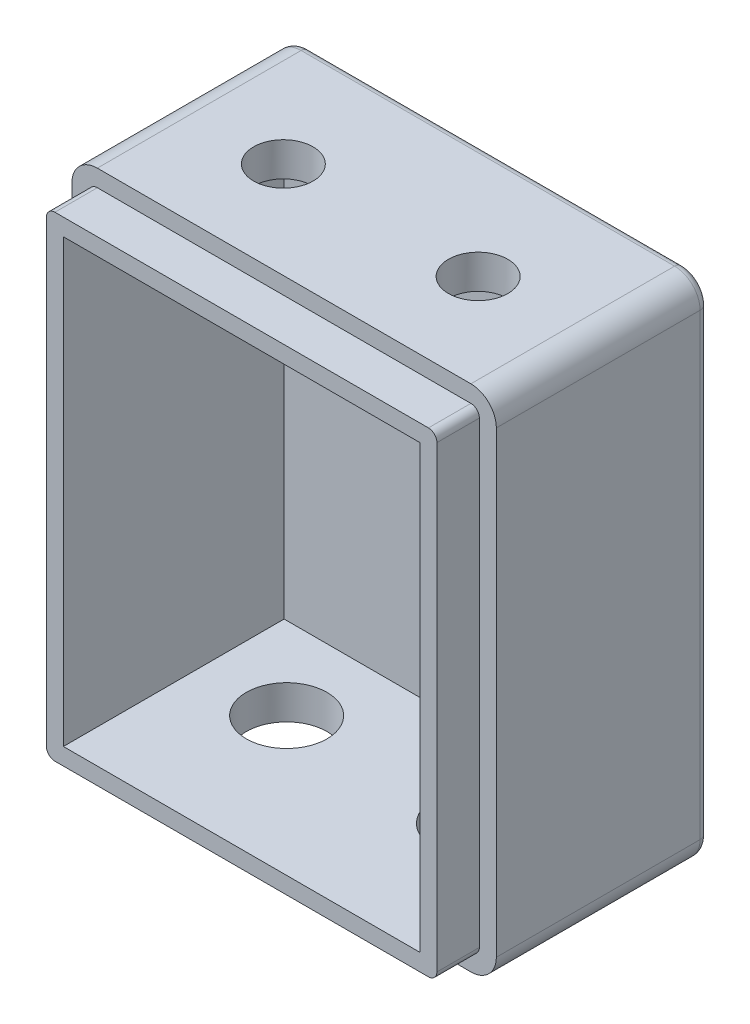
ISO-10303-21;
HEADER;
FILE_DESCRIPTION(('STEP AP214'),'2;1');
FILE_NAME('part.step','',(''),(''),'','','');
FILE_SCHEMA(('AUTOMOTIVE_DESIGN { 1 0 10303 214 1 1 1 1 }'));
ENDSEC;
DATA;
#1=APPLICATION_CONTEXT('core data for automotive mechanical design processes');
#2=APPLICATION_PROTOCOL_DEFINITION('international standard','automotive_design',2000,#1);
#3=PRODUCT_CONTEXT('',#1,'mechanical');
#4=PRODUCT('Part','Part','',(#3));
#5=PRODUCT_RELATED_PRODUCT_CATEGORY('part','',(#4));
#6=PRODUCT_DEFINITION_FORMATION('','',#4);
#7=PRODUCT_DEFINITION_CONTEXT('part definition',#1,'design');
#8=PRODUCT_DEFINITION('design','',#6,#7);
#9=PRODUCT_DEFINITION_SHAPE('','',#8);
#10=(LENGTH_UNIT() NAMED_UNIT(*) SI_UNIT(.MILLI.,.METRE.));
#11=(NAMED_UNIT(*) PLANE_ANGLE_UNIT() SI_UNIT($,.RADIAN.));
#12=(NAMED_UNIT(*) SI_UNIT($,.STERADIAN.) SOLID_ANGLE_UNIT());
#13=UNCERTAINTY_MEASURE_WITH_UNIT(LENGTH_MEASURE(1.E-05),#10,'distance_accuracy_value','');
#14=(GEOMETRIC_REPRESENTATION_CONTEXT(3) GLOBAL_UNCERTAINTY_ASSIGNED_CONTEXT((#13)) GLOBAL_UNIT_ASSIGNED_CONTEXT((#10,
#11,#12)) REPRESENTATION_CONTEXT('',''));
#15=CARTESIAN_POINT('',(0.,0.,0.));
#16=DIRECTION('',(0.,0.,1.));
#17=DIRECTION('',(1.,0.,0.));
#18=AXIS2_PLACEMENT_3D('',#15,#16,#17);
#19=CARTESIAN_POINT('',(0.,0.,30.));
#20=DIRECTION('',(0.,0.,-1.));
#21=DIRECTION('',(-1.,0.,0.));
#22=AXIS2_PLACEMENT_3D('',#19,#20,#21);
#23=PLANE('',#22);
#24=DIRECTION('',(1.,0.,0.));
#25=VECTOR('',#24,1.);
#26=CARTESIAN_POINT('',(0.,4.,30.));
#27=LINE('',#26,#25);
#28=CARTESIAN_POINT('',(4.,4.,30.));
#29=VERTEX_POINT('',#28);
#30=CARTESIAN_POINT('',(46.,4.,30.));
#31=VERTEX_POINT('',#30);
#32=EDGE_CURVE('E311',#29,#31,#27,.T.);
#33=ORIENTED_EDGE('',*,*,#32,.F.);
#34=DIRECTION('',(0.,-1.,0.));
#35=VECTOR('',#34,1.);
#36=CARTESIAN_POINT('',(4.,0.,30.));
#37=LINE('',#36,#35);
#38=CARTESIAN_POINT('',(4.,56.,30.));
#39=VERTEX_POINT('',#38);
#40=EDGE_CURVE('E308',#39,#29,#37,.T.);
#41=ORIENTED_EDGE('',*,*,#40,.F.);
#42=DIRECTION('',(-1.,0.,0.));
#43=VECTOR('',#42,1.);
#44=CARTESIAN_POINT('',(0.,56.,30.));
#45=LINE('',#44,#43);
#46=CARTESIAN_POINT('',(46.,56.,30.));
#47=VERTEX_POINT('',#46);
#48=EDGE_CURVE('E306',#47,#39,#45,.T.);
#49=ORIENTED_EDGE('',*,*,#48,.F.);
#50=DIRECTION('',(0.,1.,0.));
#51=VECTOR('',#50,1.);
#52=CARTESIAN_POINT('',(46.,0.,30.));
#53=LINE('',#52,#51);
#54=EDGE_CURVE('E314',#31,#47,#53,.T.);
#55=ORIENTED_EDGE('',*,*,#54,.F.);
#56=EDGE_LOOP('',(#33,#41,#49,#55));
#57=FACE_BOUND('',#56,.T.);
#58=CARTESIAN_POINT('',(3.,3.,30.));
#59=DIRECTION('',(0.,0.,1.));
#60=DIRECTION('',(1.,0.,0.));
#61=AXIS2_PLACEMENT_3D('',#58,#59,#60);
#62=CIRCLE('',#61,1.);
#63=CARTESIAN_POINT('',(2.,3.,30.));
#64=VERTEX_POINT('',#63);
#65=CARTESIAN_POINT('',(3.,2.,30.));
#66=VERTEX_POINT('',#65);
#67=EDGE_CURVE('E246',#64,#66,#62,.T.);
#68=ORIENTED_EDGE('',*,*,#67,.T.);
#69=DIRECTION('',(1.,0.,0.));
#70=VECTOR('',#69,1.);
#71=CARTESIAN_POINT('',(3.,2.,30.));
#72=LINE('',#71,#70);
#73=CARTESIAN_POINT('',(47.,2.,30.));
#74=VERTEX_POINT('',#73);
#75=EDGE_CURVE('E203',#66,#74,#72,.T.);
#76=ORIENTED_EDGE('',*,*,#75,.T.);
#77=CARTESIAN_POINT('',(47.,3.,30.));
#78=DIRECTION('',(0.,0.,1.));
#79=DIRECTION('',(1.,0.,0.));
#80=AXIS2_PLACEMENT_3D('',#77,#78,#79);
#81=CIRCLE('',#80,1.);
#82=CARTESIAN_POINT('',(48.,3.,30.));
#83=VERTEX_POINT('',#82);
#84=EDGE_CURVE('E52',#74,#83,#81,.T.);
#85=ORIENTED_EDGE('',*,*,#84,.T.);
#86=DIRECTION('',(0.,1.,0.));
#87=VECTOR('',#86,1.);
#88=CARTESIAN_POINT('',(48.,3.,30.));
#89=LINE('',#88,#87);
#90=CARTESIAN_POINT('',(48.,57.,30.));
#91=VERTEX_POINT('',#90);
#92=EDGE_CURVE('E250',#83,#91,#89,.T.);
#93=ORIENTED_EDGE('',*,*,#92,.T.);
#94=CARTESIAN_POINT('',(47.,57.,30.));
#95=DIRECTION('',(0.,0.,1.));
#96=DIRECTION('',(1.,0.,0.));
#97=AXIS2_PLACEMENT_3D('',#94,#95,#96);
#98=CIRCLE('',#97,1.);
#99=CARTESIAN_POINT('',(47.,58.,30.));
#100=VERTEX_POINT('',#99);
#101=EDGE_CURVE('E253',#91,#100,#98,.T.);
#102=ORIENTED_EDGE('',*,*,#101,.T.);
#103=DIRECTION('',(-1.,0.,0.));
#104=VECTOR('',#103,1.);
#105=CARTESIAN_POINT('',(47.,58.,30.));
#106=LINE('',#105,#104);
#107=CARTESIAN_POINT('',(3.,58.,30.));
#108=VERTEX_POINT('',#107);
#109=EDGE_CURVE('E256',#100,#108,#106,.T.);
#110=ORIENTED_EDGE('',*,*,#109,.T.);
#111=CARTESIAN_POINT('',(3.,57.,30.));
#112=DIRECTION('',(0.,0.,1.));
#113=DIRECTION('',(1.,0.,0.));
#114=AXIS2_PLACEMENT_3D('',#111,#112,#113);
#115=CIRCLE('',#114,1.);
#116=CARTESIAN_POINT('',(2.,57.,30.));
#117=VERTEX_POINT('',#116);
#118=EDGE_CURVE('E226',#108,#117,#115,.T.);
#119=ORIENTED_EDGE('',*,*,#118,.T.);
#120=DIRECTION('',(0.,-1.,0.));
#121=VECTOR('',#120,1.);
#122=CARTESIAN_POINT('',(2.,57.,30.));
#123=LINE('',#122,#121);
#124=EDGE_CURVE('E223',#117,#64,#123,.T.);
#125=ORIENTED_EDGE('',*,*,#124,.T.);
#126=EDGE_LOOP('',(#68,#76,#85,#93,#102,#110,#119,#125));
#127=FACE_BOUND('',#126,.T.);
#128=ADVANCED_FACE('F35',(#57,#127),#23,.F.);
#129=CARTESIAN_POINT('',(4.,0.,30.));
#130=DIRECTION('',(1.,0.,0.));
#131=DIRECTION('',(0.,0.,-1.));
#132=AXIS2_PLACEMENT_3D('',#129,#130,#131);
#133=PLANE('',#132);
#134=DIRECTION('',(0.,-1.,0.));
#135=VECTOR('',#134,1.);
#136=CARTESIAN_POINT('',(4.,0.,4.));
#137=LINE('',#136,#135);
#138=CARTESIAN_POINT('',(4.,56.,4.));
#139=VERTEX_POINT('',#138);
#140=CARTESIAN_POINT('',(4.,4.,4.));
#141=VERTEX_POINT('',#140);
#142=EDGE_CURVE('E289',#139,#141,#137,.T.);
#143=ORIENTED_EDGE('',*,*,#142,.F.);
#144=DIRECTION('',(0.,0.,1.));
#145=VECTOR('',#144,1.);
#146=CARTESIAN_POINT('',(4.,56.,30.));
#147=LINE('',#146,#145);
#148=EDGE_CURVE('E294',#139,#39,#147,.T.);
#149=ORIENTED_EDGE('',*,*,#148,.T.);
#150=ORIENTED_EDGE('',*,*,#40,.T.);
#151=DIRECTION('',(0.,0.,1.));
#152=VECTOR('',#151,1.);
#153=CARTESIAN_POINT('',(4.,4.,30.));
#154=LINE('',#153,#152);
#155=EDGE_CURVE('E292',#141,#29,#154,.T.);
#156=ORIENTED_EDGE('',*,*,#155,.F.);
#157=EDGE_LOOP('',(#143,#149,#150,#156));
#158=FACE_BOUND('',#157,.T.);
#159=ADVANCED_FACE('F471',(#158),#133,.T.);
#160=CARTESIAN_POINT('',(0.,4.,30.));
#161=DIRECTION('',(0.,1.,0.));
#162=DIRECTION('',(0.,0.,1.));
#163=AXIS2_PLACEMENT_3D('',#160,#161,#162);
#164=PLANE('',#163);
#165=CARTESIAN_POINT('',(14.,4.,13.7001851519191));
#166=DIRECTION('',(0.,1.,0.));
#167=DIRECTION('',(0.,0.,1.));
#168=AXIS2_PLACEMENT_3D('',#165,#166,#167);
#169=CIRCLE('',#168,4.75);
#170=CARTESIAN_POINT('',(14.,4.,18.4501851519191));
#171=VERTEX_POINT('',#170);
#172=EDGE_CURVE('E789',#171,#171,#169,.F.);
#173=ORIENTED_EDGE('',*,*,#172,.T.);
#174=EDGE_LOOP('',(#173));
#175=FACE_BOUND('',#174,.T.);
#176=CARTESIAN_POINT('',(36.,4.,13.7001851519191));
#177=DIRECTION('',(0.,1.,0.));
#178=DIRECTION('',(0.,0.,1.));
#179=AXIS2_PLACEMENT_3D('',#176,#177,#178);
#180=CIRCLE('',#179,4.75);
#181=CARTESIAN_POINT('',(36.,4.,18.4501851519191));
#182=VERTEX_POINT('',#181);
#183=EDGE_CURVE('E793',#182,#182,#180,.F.);
#184=ORIENTED_EDGE('',*,*,#183,.T.);
#185=EDGE_LOOP('',(#184));
#186=FACE_BOUND('',#185,.T.);
#187=DIRECTION('',(1.,0.,0.));
#188=VECTOR('',#187,1.);
#189=CARTESIAN_POINT('',(0.,4.,4.));
#190=LINE('',#189,#188);
#191=CARTESIAN_POINT('',(46.,4.,4.));
#192=VERTEX_POINT('',#191);
#193=EDGE_CURVE('E291',#141,#192,#190,.T.);
#194=ORIENTED_EDGE('',*,*,#193,.F.);
#195=ORIENTED_EDGE('',*,*,#155,.T.);
#196=ORIENTED_EDGE('',*,*,#32,.T.);
#197=DIRECTION('',(0.,0.,1.));
#198=VECTOR('',#197,1.);
#199=CARTESIAN_POINT('',(46.,4.,30.));
#200=LINE('',#199,#198);
#201=EDGE_CURVE('E295',#192,#31,#200,.T.);
#202=ORIENTED_EDGE('',*,*,#201,.F.);
#203=EDGE_LOOP('',(#194,#195,#196,#202));
#204=FACE_BOUND('',#203,.T.);
#205=ADVANCED_FACE('F477',(#175,#186,#204),#164,.T.);
#206=CARTESIAN_POINT('',(46.,0.,30.));
#207=DIRECTION('',(-1.,0.,0.));
#208=DIRECTION('',(0.,0.,1.));
#209=AXIS2_PLACEMENT_3D('',#206,#207,#208);
#210=PLANE('',#209);
#211=ORIENTED_EDGE('',*,*,#54,.T.);
#212=DIRECTION('',(0.,0.,1.));
#213=VECTOR('',#212,1.);
#214=CARTESIAN_POINT('',(46.,56.,30.));
#215=LINE('',#214,#213);
#216=CARTESIAN_POINT('',(46.,56.,4.));
#217=VERTEX_POINT('',#216);
#218=EDGE_CURVE('E302',#217,#47,#215,.T.);
#219=ORIENTED_EDGE('',*,*,#218,.F.);
#220=DIRECTION('',(0.,1.,0.));
#221=VECTOR('',#220,1.);
#222=CARTESIAN_POINT('',(46.,0.,4.));
#223=LINE('',#222,#221);
#224=EDGE_CURVE('E300',#192,#217,#223,.T.);
#225=ORIENTED_EDGE('',*,*,#224,.F.);
#226=ORIENTED_EDGE('',*,*,#201,.T.);
#227=EDGE_LOOP('',(#211,#219,#225,#226));
#228=FACE_BOUND('',#227,.T.);
#229=ADVANCED_FACE('F737',(#228),#210,.T.);
#230=CARTESIAN_POINT('',(0.,56.,30.));
#231=DIRECTION('',(0.,-1.,0.));
#232=DIRECTION('',(0.,0.,-1.));
#233=AXIS2_PLACEMENT_3D('',#230,#231,#232);
#234=PLANE('',#233);
#235=CARTESIAN_POINT('',(36.4730775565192,56.,13.6186261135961));
#236=DIRECTION('',(0.,-1.,0.));
#237=DIRECTION('',(0.,0.,-1.));
#238=AXIS2_PLACEMENT_3D('',#235,#236,#237);
#239=CIRCLE('',#238,3.5);
#240=CARTESIAN_POINT('',(36.4730775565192,56.,10.1186261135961));
#241=VERTEX_POINT('',#240);
#242=EDGE_CURVE('E819',#241,#241,#239,.F.);
#243=ORIENTED_EDGE('',*,*,#242,.T.);
#244=EDGE_LOOP('',(#243));
#245=FACE_BOUND('',#244,.T.);
#246=CARTESIAN_POINT('',(13.5269224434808,56.,13.6186261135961));
#247=DIRECTION('',(0.,-1.,0.));
#248=DIRECTION('',(0.,0.,-1.));
#249=AXIS2_PLACEMENT_3D('',#246,#247,#248);
#250=CIRCLE('',#249,3.5);
#251=CARTESIAN_POINT('',(13.5269224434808,56.,10.1186261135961));
#252=VERTEX_POINT('',#251);
#253=EDGE_CURVE('E813',#252,#252,#250,.F.);
#254=ORIENTED_EDGE('',*,*,#253,.T.);
#255=EDGE_LOOP('',(#254));
#256=FACE_BOUND('',#255,.T.);
#257=DIRECTION('',(-1.,0.,0.));
#258=VECTOR('',#257,1.);
#259=CARTESIAN_POINT('',(0.,56.,4.));
#260=LINE('',#259,#258);
#261=EDGE_CURVE('E304',#217,#139,#260,.T.);
#262=ORIENTED_EDGE('',*,*,#261,.F.);
#263=ORIENTED_EDGE('',*,*,#218,.T.);
#264=ORIENTED_EDGE('',*,*,#48,.T.);
#265=ORIENTED_EDGE('',*,*,#148,.F.);
#266=EDGE_LOOP('',(#262,#263,#264,#265));
#267=FACE_BOUND('',#266,.T.);
#268=ADVANCED_FACE('F729',(#245,#256,#267),#234,.T.);
#269=CARTESIAN_POINT('',(0.,0.,4.));
#270=DIRECTION('',(0.,0.,-1.));
#271=DIRECTION('',(-1.,0.,0.));
#272=AXIS2_PLACEMENT_3D('',#269,#270,#271);
#273=PLANE('',#272);
#274=ORIENTED_EDGE('',*,*,#224,.T.);
#275=ORIENTED_EDGE('',*,*,#261,.T.);
#276=ORIENTED_EDGE('',*,*,#142,.T.);
#277=ORIENTED_EDGE('',*,*,#193,.T.);
#278=EDGE_LOOP('',(#274,#275,#276,#277));
#279=FACE_BOUND('',#278,.T.);
#280=ADVANCED_FACE('F484',(#279),#273,.F.);
#281=CARTESIAN_POINT('',(3.,3.,25.));
#282=DIRECTION('',(0.,0.,1.));
#283=DIRECTION('',(1.,0.,0.));
#284=AXIS2_PLACEMENT_3D('',#281,#282,#283);
#285=PLANE('',#284);
#286=DIRECTION('',(0.,-1.,0.));
#287=VECTOR('',#286,1.);
#288=CARTESIAN_POINT('',(2.,57.,25.));
#289=LINE('',#288,#287);
#290=CARTESIAN_POINT('',(2.,57.,25.));
#291=VERTEX_POINT('',#290);
#292=CARTESIAN_POINT('',(2.,3.,25.));
#293=VERTEX_POINT('',#292);
#294=EDGE_CURVE('E209',#291,#293,#289,.T.);
#295=ORIENTED_EDGE('',*,*,#294,.F.);
#296=CARTESIAN_POINT('',(3.,57.,25.));
#297=DIRECTION('',(0.,0.,1.));
#298=DIRECTION('',(1.,0.,0.));
#299=AXIS2_PLACEMENT_3D('',#296,#297,#298);
#300=CIRCLE('',#299,1.);
#301=CARTESIAN_POINT('',(3.,58.,25.));
#302=VERTEX_POINT('',#301);
#303=EDGE_CURVE('E242',#302,#291,#300,.T.);
#304=ORIENTED_EDGE('',*,*,#303,.F.);
#305=DIRECTION('',(-1.,0.,0.));
#306=VECTOR('',#305,1.);
#307=CARTESIAN_POINT('',(47.,58.,25.));
#308=LINE('',#307,#306);
#309=CARTESIAN_POINT('',(47.,58.,25.));
#310=VERTEX_POINT('',#309);
#311=EDGE_CURVE('E239',#310,#302,#308,.T.);
#312=ORIENTED_EDGE('',*,*,#311,.F.);
#313=CARTESIAN_POINT('',(47.,57.,25.));
#314=DIRECTION('',(0.,0.,1.));
#315=DIRECTION('',(1.,0.,0.));
#316=AXIS2_PLACEMENT_3D('',#313,#314,#315);
#317=CIRCLE('',#316,1.);
#318=CARTESIAN_POINT('',(48.,57.,25.));
#319=VERTEX_POINT('',#318);
#320=EDGE_CURVE('E236',#319,#310,#317,.T.);
#321=ORIENTED_EDGE('',*,*,#320,.F.);
#322=DIRECTION('',(0.,1.,0.));
#323=VECTOR('',#322,1.);
#324=CARTESIAN_POINT('',(48.,3.,25.));
#325=LINE('',#324,#323);
#326=CARTESIAN_POINT('',(48.,3.,25.));
#327=VERTEX_POINT('',#326);
#328=EDGE_CURVE('E233',#327,#319,#325,.T.);
#329=ORIENTED_EDGE('',*,*,#328,.F.);
#330=CARTESIAN_POINT('',(47.,3.,25.));
#331=DIRECTION('',(0.,0.,1.));
#332=DIRECTION('',(1.,0.,0.));
#333=AXIS2_PLACEMENT_3D('',#330,#331,#332);
#334=CIRCLE('',#333,1.);
#335=CARTESIAN_POINT('',(47.,2.,25.));
#336=VERTEX_POINT('',#335);
#337=EDGE_CURVE('E219',#336,#327,#334,.T.);
#338=ORIENTED_EDGE('',*,*,#337,.F.);
#339=DIRECTION('',(1.,0.,0.));
#340=VECTOR('',#339,1.);
#341=CARTESIAN_POINT('',(3.,2.,25.));
#342=LINE('',#341,#340);
#343=CARTESIAN_POINT('',(3.,2.,25.));
#344=VERTEX_POINT('',#343);
#345=EDGE_CURVE('E201',#344,#336,#342,.T.);
#346=ORIENTED_EDGE('',*,*,#345,.F.);
#347=CARTESIAN_POINT('',(3.,3.,25.));
#348=DIRECTION('',(0.,0.,1.));
#349=DIRECTION('',(1.,0.,0.));
#350=AXIS2_PLACEMENT_3D('',#347,#348,#349);
#351=CIRCLE('',#350,1.);
#352=EDGE_CURVE('E215',#293,#344,#351,.T.);
#353=ORIENTED_EDGE('',*,*,#352,.F.);
#354=EDGE_LOOP('',(#295,#304,#312,#321,#329,#338,#346,#353));
#355=FACE_BOUND('',#354,.T.);
#356=CARTESIAN_POINT('',(3.,3.,25.));
#357=DIRECTION('',(0.,0.,1.));
#358=DIRECTION('',(1.,0.,0.));
#359=AXIS2_PLACEMENT_3D('',#356,#357,#358);
#360=CIRCLE('',#359,3.);
#361=CARTESIAN_POINT('',(0.,3.,25.));
#362=VERTEX_POINT('',#361);
#363=CARTESIAN_POINT('',(3.,0.,25.));
#364=VERTEX_POINT('',#363);
#365=EDGE_CURVE('E262',#362,#364,#360,.T.);
#366=ORIENTED_EDGE('',*,*,#365,.T.);
#367=DIRECTION('',(1.,0.,0.));
#368=VECTOR('',#367,1.);
#369=CARTESIAN_POINT('',(3.,0.,25.));
#370=LINE('',#369,#368);
#371=CARTESIAN_POINT('',(47.,0.,25.));
#372=VERTEX_POINT('',#371);
#373=EDGE_CURVE('E275',#364,#372,#370,.T.);
#374=ORIENTED_EDGE('',*,*,#373,.T.);
#375=CARTESIAN_POINT('',(47.,3.,25.));
#376=DIRECTION('',(0.,0.,1.));
#377=DIRECTION('',(1.,0.,0.));
#378=AXIS2_PLACEMENT_3D('',#375,#376,#377);
#379=CIRCLE('',#378,3.);
#380=CARTESIAN_POINT('',(50.,3.,25.));
#381=VERTEX_POINT('',#380);
#382=EDGE_CURVE('E277',#372,#381,#379,.T.);
#383=ORIENTED_EDGE('',*,*,#382,.T.);
#384=DIRECTION('',(0.,1.,0.));
#385=VECTOR('',#384,1.);
#386=CARTESIAN_POINT('',(50.,3.,25.));
#387=LINE('',#386,#385);
#388=CARTESIAN_POINT('',(50.,57.,25.));
#389=VERTEX_POINT('',#388);
#390=EDGE_CURVE('E60',#381,#389,#387,.T.);
#391=ORIENTED_EDGE('',*,*,#390,.T.);
#392=CARTESIAN_POINT('',(47.,57.,25.));
#393=DIRECTION('',(0.,0.,1.));
#394=DIRECTION('',(1.,0.,0.));
#395=AXIS2_PLACEMENT_3D('',#392,#393,#394);
#396=CIRCLE('',#395,3.);
#397=CARTESIAN_POINT('',(47.,60.,25.));
#398=VERTEX_POINT('',#397);
#399=EDGE_CURVE('E280',#389,#398,#396,.T.);
#400=ORIENTED_EDGE('',*,*,#399,.T.);
#401=DIRECTION('',(-1.,0.,0.));
#402=VECTOR('',#401,1.);
#403=CARTESIAN_POINT('',(47.,60.,25.));
#404=LINE('',#403,#402);
#405=CARTESIAN_POINT('',(3.,60.,25.));
#406=VERTEX_POINT('',#405);
#407=EDGE_CURVE('E282',#398,#406,#404,.T.);
#408=ORIENTED_EDGE('',*,*,#407,.T.);
#409=CARTESIAN_POINT('',(3.,57.,25.));
#410=DIRECTION('',(0.,0.,1.));
#411=DIRECTION('',(1.,0.,0.));
#412=AXIS2_PLACEMENT_3D('',#409,#410,#411);
#413=CIRCLE('',#412,3.);
#414=CARTESIAN_POINT('',(0.,57.,25.));
#415=VERTEX_POINT('',#414);
#416=EDGE_CURVE('E284',#406,#415,#413,.T.);
#417=ORIENTED_EDGE('',*,*,#416,.T.);
#418=DIRECTION('',(0.,-1.,0.));
#419=VECTOR('',#418,1.);
#420=CARTESIAN_POINT('',(0.,57.,25.));
#421=LINE('',#420,#419);
#422=EDGE_CURVE('E286',#415,#362,#421,.T.);
#423=ORIENTED_EDGE('',*,*,#422,.T.);
#424=EDGE_LOOP('',(#366,#374,#383,#391,#400,#408,#417,#423));
#425=FACE_BOUND('',#424,.T.);
#426=ADVANCED_FACE('F214',(#355,#425),#285,.T.);
#427=CARTESIAN_POINT('',(3.,3.,25.));
#428=DIRECTION('',(0.,0.,1.));
#429=DIRECTION('',(1.,0.,0.));
#430=AXIS2_PLACEMENT_3D('',#427,#428,#429);
#431=CYLINDRICAL_SURFACE('',#430,1.);
#432=ORIENTED_EDGE('',*,*,#67,.F.);
#433=DIRECTION('',(0.,0.,1.));
#434=VECTOR('',#433,1.);
#435=CARTESIAN_POINT('',(2.,3.,25.));
#436=LINE('',#435,#434);
#437=EDGE_CURVE('E222',#293,#64,#436,.T.);
#438=ORIENTED_EDGE('',*,*,#437,.F.);
#439=ORIENTED_EDGE('',*,*,#352,.T.);
#440=DIRECTION('',(0.,0.,1.));
#441=VECTOR('',#440,1.);
#442=CARTESIAN_POINT('',(3.,2.,25.));
#443=LINE('',#442,#441);
#444=EDGE_CURVE('E198',#344,#66,#443,.T.);
#445=ORIENTED_EDGE('',*,*,#444,.T.);
#446=EDGE_LOOP('',(#432,#438,#439,#445));
#447=FACE_BOUND('',#446,.T.);
#448=ADVANCED_FACE('F221',(#447),#431,.T.);
#449=CARTESIAN_POINT('',(2.,57.,25.));
#450=DIRECTION('',(-1.,0.,0.));
#451=DIRECTION('',(0.,-1.,0.));
#452=AXIS2_PLACEMENT_3D('',#449,#450,#451);
#453=PLANE('',#452);
#454=ORIENTED_EDGE('',*,*,#124,.F.);
#455=DIRECTION('',(0.,0.,1.));
#456=VECTOR('',#455,1.);
#457=CARTESIAN_POINT('',(2.,57.,25.));
#458=LINE('',#457,#456);
#459=EDGE_CURVE('E263',#291,#117,#458,.T.);
#460=ORIENTED_EDGE('',*,*,#459,.F.);
#461=ORIENTED_EDGE('',*,*,#294,.T.);
#462=ORIENTED_EDGE('',*,*,#437,.T.);
#463=EDGE_LOOP('',(#454,#460,#461,#462));
#464=FACE_BOUND('',#463,.T.);
#465=ADVANCED_FACE('F605',(#464),#453,.T.);
#466=CARTESIAN_POINT('',(3.,57.,25.));
#467=DIRECTION('',(0.,0.,1.));
#468=DIRECTION('',(1.,0.,0.));
#469=AXIS2_PLACEMENT_3D('',#466,#467,#468);
#470=CYLINDRICAL_SURFACE('',#469,1.);
#471=ORIENTED_EDGE('',*,*,#118,.F.);
#472=DIRECTION('',(0.,0.,1.));
#473=VECTOR('',#472,1.);
#474=CARTESIAN_POINT('',(3.,58.,25.));
#475=LINE('',#474,#473);
#476=EDGE_CURVE('E265',#302,#108,#475,.T.);
#477=ORIENTED_EDGE('',*,*,#476,.F.);
#478=ORIENTED_EDGE('',*,*,#303,.T.);
#479=ORIENTED_EDGE('',*,*,#459,.T.);
#480=EDGE_LOOP('',(#471,#477,#478,#479));
#481=FACE_BOUND('',#480,.T.);
#482=ADVANCED_FACE('F596',(#481),#470,.T.);
#483=CARTESIAN_POINT('',(47.,58.,25.));
#484=DIRECTION('',(0.,1.,0.));
#485=DIRECTION('',(0.,0.,1.));
#486=AXIS2_PLACEMENT_3D('',#483,#484,#485);
#487=PLANE('',#486);
#488=ORIENTED_EDGE('',*,*,#109,.F.);
#489=DIRECTION('',(0.,0.,1.));
#490=VECTOR('',#489,1.);
#491=CARTESIAN_POINT('',(47.,58.,25.));
#492=LINE('',#491,#490);
#493=EDGE_CURVE('E267',#310,#100,#492,.T.);
#494=ORIENTED_EDGE('',*,*,#493,.F.);
#495=ORIENTED_EDGE('',*,*,#311,.T.);
#496=ORIENTED_EDGE('',*,*,#476,.T.);
#497=EDGE_LOOP('',(#488,#494,#495,#496));
#498=FACE_BOUND('',#497,.T.);
#499=ADVANCED_FACE('F587',(#498),#487,.T.);
#500=CARTESIAN_POINT('',(47.,57.,25.));
#501=DIRECTION('',(0.,0.,1.));
#502=DIRECTION('',(1.,0.,0.));
#503=AXIS2_PLACEMENT_3D('',#500,#501,#502);
#504=CYLINDRICAL_SURFACE('',#503,1.);
#505=ORIENTED_EDGE('',*,*,#101,.F.);
#506=DIRECTION('',(0.,0.,1.));
#507=VECTOR('',#506,1.);
#508=CARTESIAN_POINT('',(48.,57.,25.));
#509=LINE('',#508,#507);
#510=EDGE_CURVE('E269',#319,#91,#509,.T.);
#511=ORIENTED_EDGE('',*,*,#510,.F.);
#512=ORIENTED_EDGE('',*,*,#320,.T.);
#513=ORIENTED_EDGE('',*,*,#493,.T.);
#514=EDGE_LOOP('',(#505,#511,#512,#513));
#515=FACE_BOUND('',#514,.T.);
#516=ADVANCED_FACE('F578',(#515),#504,.T.);
#517=CARTESIAN_POINT('',(48.,3.,25.));
#518=DIRECTION('',(1.,0.,0.));
#519=DIRECTION('',(0.,0.,-1.));
#520=AXIS2_PLACEMENT_3D('',#517,#518,#519);
#521=PLANE('',#520);
#522=ORIENTED_EDGE('',*,*,#92,.F.);
#523=DIRECTION('',(0.,0.,1.));
#524=VECTOR('',#523,1.);
#525=CARTESIAN_POINT('',(48.,3.,25.));
#526=LINE('',#525,#524);
#527=EDGE_CURVE('E271',#327,#83,#526,.T.);
#528=ORIENTED_EDGE('',*,*,#527,.F.);
#529=ORIENTED_EDGE('',*,*,#328,.T.);
#530=ORIENTED_EDGE('',*,*,#510,.T.);
#531=EDGE_LOOP('',(#522,#528,#529,#530));
#532=FACE_BOUND('',#531,.T.);
#533=ADVANCED_FACE('F570',(#532),#521,.T.);
#534=CARTESIAN_POINT('',(47.,3.,25.));
#535=DIRECTION('',(0.,0.,1.));
#536=DIRECTION('',(1.,0.,0.));
#537=AXIS2_PLACEMENT_3D('',#534,#535,#536);
#538=CYLINDRICAL_SURFACE('',#537,1.);
#539=ORIENTED_EDGE('',*,*,#84,.F.);
#540=DIRECTION('',(0.,0.,1.));
#541=VECTOR('',#540,1.);
#542=CARTESIAN_POINT('',(47.,2.,25.));
#543=LINE('',#542,#541);
#544=EDGE_CURVE('E208',#336,#74,#543,.T.);
#545=ORIENTED_EDGE('',*,*,#544,.F.);
#546=ORIENTED_EDGE('',*,*,#337,.T.);
#547=ORIENTED_EDGE('',*,*,#527,.T.);
#548=EDGE_LOOP('',(#539,#545,#546,#547));
#549=FACE_BOUND('',#548,.T.);
#550=ADVANCED_FACE('F561',(#549),#538,.T.);
#551=CARTESIAN_POINT('',(3.,2.,25.));
#552=DIRECTION('',(0.,-1.,0.));
#553=DIRECTION('',(0.,0.,-1.));
#554=AXIS2_PLACEMENT_3D('',#551,#552,#553);
#555=PLANE('',#554);
#556=ORIENTED_EDGE('',*,*,#75,.F.);
#557=ORIENTED_EDGE('',*,*,#444,.F.);
#558=ORIENTED_EDGE('',*,*,#345,.T.);
#559=ORIENTED_EDGE('',*,*,#544,.T.);
#560=EDGE_LOOP('',(#556,#557,#558,#559));
#561=FACE_BOUND('',#560,.T.);
#562=ADVANCED_FACE('F200',(#561),#555,.T.);
#563=CARTESIAN_POINT('',(0.,0.,0.));
#564=DIRECTION('',(0.,0.,-1.));
#565=DIRECTION('',(-1.,0.,0.));
#566=AXIS2_PLACEMENT_3D('',#563,#564,#565);
#567=PLANE('',#566);
#568=DIRECTION('',(-1.,0.,0.));
#569=VECTOR('',#568,1.);
#570=CARTESIAN_POINT('',(47.,59.,0.));
#571=LINE('',#570,#569);
#572=CARTESIAN_POINT('',(3.,59.,0.));
#573=VERTEX_POINT('',#572);
#574=CARTESIAN_POINT('',(47.,59.,0.));
#575=VERTEX_POINT('',#574);
#576=EDGE_CURVE('E349',#573,#575,#571,.F.);
#577=ORIENTED_EDGE('',*,*,#576,.T.);
#578=CARTESIAN_POINT('',(47.,57.,0.));
#579=DIRECTION('',(0.,0.,-1.));
#580=DIRECTION('',(-1.,0.,0.));
#581=AXIS2_PLACEMENT_3D('',#578,#579,#580);
#582=CIRCLE('',#581,2.);
#583=CARTESIAN_POINT('',(49.,57.,0.));
#584=VERTEX_POINT('',#583);
#585=EDGE_CURVE('E351',#575,#584,#582,.T.);
#586=ORIENTED_EDGE('',*,*,#585,.T.);
#587=DIRECTION('',(0.,1.,0.));
#588=VECTOR('',#587,1.);
#589=CARTESIAN_POINT('',(49.,3.,0.));
#590=LINE('',#589,#588);
#591=CARTESIAN_POINT('',(49.,3.,0.));
#592=VERTEX_POINT('',#591);
#593=EDGE_CURVE('E337',#584,#592,#590,.F.);
#594=ORIENTED_EDGE('',*,*,#593,.T.);
#595=CARTESIAN_POINT('',(47.,3.,0.));
#596=DIRECTION('',(0.,0.,-1.));
#597=DIRECTION('',(-1.,0.,0.));
#598=AXIS2_PLACEMENT_3D('',#595,#596,#597);
#599=CIRCLE('',#598,2.);
#600=CARTESIAN_POINT('',(47.,1.,0.));
#601=VERTEX_POINT('',#600);
#602=EDGE_CURVE('E339',#592,#601,#599,.T.);
#603=ORIENTED_EDGE('',*,*,#602,.T.);
#604=DIRECTION('',(1.,0.,0.));
#605=VECTOR('',#604,1.);
#606=CARTESIAN_POINT('',(3.,1.,0.));
#607=LINE('',#606,#605);
#608=CARTESIAN_POINT('',(3.,1.,0.));
#609=VERTEX_POINT('',#608);
#610=EDGE_CURVE('E341',#601,#609,#607,.F.);
#611=ORIENTED_EDGE('',*,*,#610,.T.);
#612=CARTESIAN_POINT('',(3.,3.,0.));
#613=DIRECTION('',(0.,0.,-1.));
#614=DIRECTION('',(-1.,0.,0.));
#615=AXIS2_PLACEMENT_3D('',#612,#613,#614);
#616=CIRCLE('',#615,2.);
#617=CARTESIAN_POINT('',(1.,3.,0.));
#618=VERTEX_POINT('',#617);
#619=EDGE_CURVE('E343',#609,#618,#616,.T.);
#620=ORIENTED_EDGE('',*,*,#619,.T.);
#621=DIRECTION('',(0.,-1.,0.));
#622=VECTOR('',#621,1.);
#623=CARTESIAN_POINT('',(1.,57.,0.));
#624=LINE('',#623,#622);
#625=CARTESIAN_POINT('',(1.,57.,0.));
#626=VERTEX_POINT('',#625);
#627=EDGE_CURVE('E345',#618,#626,#624,.F.);
#628=ORIENTED_EDGE('',*,*,#627,.T.);
#629=CARTESIAN_POINT('',(3.,57.,0.));
#630=DIRECTION('',(0.,0.,-1.));
#631=DIRECTION('',(-1.,0.,0.));
#632=AXIS2_PLACEMENT_3D('',#629,#630,#631);
#633=CIRCLE('',#632,2.);
#634=EDGE_CURVE('E347',#626,#573,#633,.T.);
#635=ORIENTED_EDGE('',*,*,#634,.T.);
#636=EDGE_LOOP('',(#577,#586,#594,#603,#611,#620,#628,#635));
#637=FACE_BOUND('',#636,.T.);
#638=ADVANCED_FACE('F427',(#637),#567,.T.);
#639=CARTESIAN_POINT('',(1.,0.,1.));
#640=DIRECTION('',(0.,1.,0.));
#641=DIRECTION('',(0.,0.,1.));
#642=AXIS2_PLACEMENT_3D('',#639,#640,#641);
#643=CYLINDRICAL_SURFACE('',#642,1.);
#644=CARTESIAN_POINT('',(1.,3.,1.));
#645=DIRECTION('',(0.,1.,0.));
#646=DIRECTION('',(0.,0.,1.));
#647=AXIS2_PLACEMENT_3D('',#644,#645,#646);
#648=CIRCLE('',#647,1.);
#649=CARTESIAN_POINT('',(0.,3.,1.));
#650=VERTEX_POINT('',#649);
#651=EDGE_CURVE('E39',#618,#650,#648,.T.);
#652=ORIENTED_EDGE('',*,*,#651,.T.);
#653=DIRECTION('',(0.,-1.,0.));
#654=VECTOR('',#653,1.);
#655=CARTESIAN_POINT('',(0.,3.,1.));
#656=LINE('',#655,#654);
#657=CARTESIAN_POINT('',(0.,57.,1.));
#658=VERTEX_POINT('',#657);
#659=EDGE_CURVE('E362',#658,#650,#656,.T.);
#660=ORIENTED_EDGE('',*,*,#659,.F.);
#661=CARTESIAN_POINT('',(1.,57.,1.));
#662=DIRECTION('',(0.,1.,0.));
#663=DIRECTION('',(0.,0.,1.));
#664=AXIS2_PLACEMENT_3D('',#661,#662,#663);
#665=CIRCLE('',#664,1.);
#666=EDGE_CURVE('E384',#626,#658,#665,.T.);
#667=ORIENTED_EDGE('',*,*,#666,.F.);
#668=ORIENTED_EDGE('',*,*,#627,.F.);
#669=EDGE_LOOP('',(#652,#660,#667,#668));
#670=FACE_BOUND('',#669,.T.);
#671=ADVANCED_FACE('F397',(#670),#643,.T.);
#672=CARTESIAN_POINT('',(0.,1.,1.));
#673=DIRECTION('',(-1.,0.,0.));
#674=DIRECTION('',(0.,0.,1.));
#675=AXIS2_PLACEMENT_3D('',#672,#673,#674);
#676=CYLINDRICAL_SURFACE('',#675,1.);
#677=CARTESIAN_POINT('',(3.,1.,1.));
#678=DIRECTION('',(1.,0.,0.));
#679=DIRECTION('',(0.,0.,-1.));
#680=AXIS2_PLACEMENT_3D('',#677,#678,#679);
#681=CIRCLE('',#680,1.);
#682=CARTESIAN_POINT('',(3.,0.,1.));
#683=VERTEX_POINT('',#682);
#684=EDGE_CURVE('E386',#683,#609,#681,.T.);
#685=ORIENTED_EDGE('',*,*,#684,.T.);
#686=ORIENTED_EDGE('',*,*,#610,.F.);
#687=CARTESIAN_POINT('',(47.,1.,1.));
#688=DIRECTION('',(1.,0.,0.));
#689=DIRECTION('',(0.,0.,-1.));
#690=AXIS2_PLACEMENT_3D('',#687,#688,#689);
#691=CIRCLE('',#690,1.);
#692=CARTESIAN_POINT('',(47.,0.,1.));
#693=VERTEX_POINT('',#692);
#694=EDGE_CURVE('E381',#693,#601,#691,.T.);
#695=ORIENTED_EDGE('',*,*,#694,.F.);
#696=DIRECTION('',(1.,0.,0.));
#697=VECTOR('',#696,1.);
#698=CARTESIAN_POINT('',(47.,0.,1.));
#699=LINE('',#698,#697);
#700=EDGE_CURVE('E367',#683,#693,#699,.T.);
#701=ORIENTED_EDGE('',*,*,#700,.F.);
#702=EDGE_LOOP('',(#685,#686,#695,#701));
#703=FACE_BOUND('',#702,.T.);
#704=ADVANCED_FACE('F430',(#703),#676,.T.);
#705=CARTESIAN_POINT('',(49.,0.,1.));
#706=DIRECTION('',(0.,-1.,0.));
#707=DIRECTION('',(0.,0.,-1.));
#708=AXIS2_PLACEMENT_3D('',#705,#706,#707);
#709=CYLINDRICAL_SURFACE('',#708,1.);
#710=CARTESIAN_POINT('',(49.,3.,1.));
#711=DIRECTION('',(0.,1.,0.));
#712=DIRECTION('',(0.,0.,1.));
#713=AXIS2_PLACEMENT_3D('',#710,#711,#712);
#714=CIRCLE('',#713,1.);
#715=CARTESIAN_POINT('',(50.,3.,1.));
#716=VERTEX_POINT('',#715);
#717=EDGE_CURVE('E375',#716,#592,#714,.T.);
#718=ORIENTED_EDGE('',*,*,#717,.T.);
#719=ORIENTED_EDGE('',*,*,#593,.F.);
#720=CARTESIAN_POINT('',(49.,57.,1.));
#721=DIRECTION('',(0.,1.,0.));
#722=DIRECTION('',(0.,0.,1.));
#723=AXIS2_PLACEMENT_3D('',#720,#721,#722);
#724=CIRCLE('',#723,1.);
#725=CARTESIAN_POINT('',(50.,57.,1.));
#726=VERTEX_POINT('',#725);
#727=EDGE_CURVE('E288',#726,#584,#724,.T.);
#728=ORIENTED_EDGE('',*,*,#727,.F.);
#729=DIRECTION('',(0.,1.,0.));
#730=VECTOR('',#729,1.);
#731=CARTESIAN_POINT('',(50.,57.,1.));
#732=LINE('',#731,#730);
#733=EDGE_CURVE('E11',#716,#726,#732,.T.);
#734=ORIENTED_EDGE('',*,*,#733,.F.);
#735=EDGE_LOOP('',(#718,#719,#728,#734));
#736=FACE_BOUND('',#735,.T.);
#737=ADVANCED_FACE('F455',(#736),#709,.T.);
#738=CARTESIAN_POINT('',(0.,59.,1.));
#739=DIRECTION('',(1.,0.,0.));
#740=DIRECTION('',(0.,0.,-1.));
#741=AXIS2_PLACEMENT_3D('',#738,#739,#740);
#742=CYLINDRICAL_SURFACE('',#741,1.);
#743=CARTESIAN_POINT('',(3.,59.,1.));
#744=DIRECTION('',(1.,0.,0.));
#745=DIRECTION('',(0.,0.,-1.));
#746=AXIS2_PLACEMENT_3D('',#743,#744,#745);
#747=CIRCLE('',#746,1.);
#748=CARTESIAN_POINT('',(3.,60.,1.));
#749=VERTEX_POINT('',#748);
#750=EDGE_CURVE('E378',#573,#749,#747,.T.);
#751=ORIENTED_EDGE('',*,*,#750,.T.);
#752=DIRECTION('',(-1.,0.,0.));
#753=VECTOR('',#752,1.);
#754=CARTESIAN_POINT('',(3.,60.,1.));
#755=LINE('',#754,#753);
#756=CARTESIAN_POINT('',(47.,60.,1.));
#757=VERTEX_POINT('',#756);
#758=EDGE_CURVE('E357',#757,#749,#755,.T.);
#759=ORIENTED_EDGE('',*,*,#758,.F.);
#760=CARTESIAN_POINT('',(47.,59.,1.));
#761=DIRECTION('',(1.,0.,0.));
#762=DIRECTION('',(0.,0.,-1.));
#763=AXIS2_PLACEMENT_3D('',#760,#761,#762);
#764=CIRCLE('',#763,1.);
#765=EDGE_CURVE('E372',#575,#757,#764,.T.);
#766=ORIENTED_EDGE('',*,*,#765,.F.);
#767=ORIENTED_EDGE('',*,*,#576,.F.);
#768=EDGE_LOOP('',(#751,#759,#766,#767));
#769=FACE_BOUND('',#768,.T.);
#770=ADVANCED_FACE('F423',(#769),#742,.T.);
#771=CARTESIAN_POINT('',(47.,3.,1.));
#772=DIRECTION('',(0.,0.,-1.));
#773=DIRECTION('',(-1.,0.,0.));
#774=AXIS2_PLACEMENT_3D('',#771,#772,#773);
#775=TOROIDAL_SURFACE('',#774,2.,1.);
#776=ORIENTED_EDGE('',*,*,#694,.T.);
#777=ORIENTED_EDGE('',*,*,#602,.F.);
#778=ORIENTED_EDGE('',*,*,#717,.F.);
#779=CARTESIAN_POINT('',(47.,3.,1.));
#780=DIRECTION('',(0.,0.,-1.));
#781=DIRECTION('',(-1.,0.,0.));
#782=AXIS2_PLACEMENT_3D('',#779,#780,#781);
#783=CIRCLE('',#782,3.);
#784=EDGE_CURVE('E44',#693,#716,#783,.F.);
#785=ORIENTED_EDGE('',*,*,#784,.F.);
#786=EDGE_LOOP('',(#776,#777,#778,#785));
#787=FACE_BOUND('',#786,.T.);
#788=ADVANCED_FACE('F433',(#787),#775,.T.);
#789=CARTESIAN_POINT('',(3.,3.,1.));
#790=DIRECTION('',(0.,0.,-1.));
#791=DIRECTION('',(-1.,0.,0.));
#792=AXIS2_PLACEMENT_3D('',#789,#790,#791);
#793=TOROIDAL_SURFACE('',#792,2.,1.);
#794=ORIENTED_EDGE('',*,*,#684,.F.);
#795=CARTESIAN_POINT('',(3.,3.,1.));
#796=DIRECTION('',(0.,0.,-1.));
#797=DIRECTION('',(-1.,0.,0.));
#798=AXIS2_PLACEMENT_3D('',#795,#796,#797);
#799=CIRCLE('',#798,3.);
#800=EDGE_CURVE('E364',#650,#683,#799,.F.);
#801=ORIENTED_EDGE('',*,*,#800,.F.);
#802=ORIENTED_EDGE('',*,*,#651,.F.);
#803=ORIENTED_EDGE('',*,*,#619,.F.);
#804=EDGE_LOOP('',(#794,#801,#802,#803));
#805=FACE_BOUND('',#804,.T.);
#806=ADVANCED_FACE('F37',(#805),#793,.T.);
#807=CARTESIAN_POINT('',(3.,57.,1.));
#808=DIRECTION('',(0.,0.,-1.));
#809=DIRECTION('',(-1.,0.,0.));
#810=AXIS2_PLACEMENT_3D('',#807,#808,#809);
#811=TOROIDAL_SURFACE('',#810,2.,1.);
#812=ORIENTED_EDGE('',*,*,#666,.T.);
#813=CARTESIAN_POINT('',(3.,57.,1.));
#814=DIRECTION('',(0.,0.,-1.));
#815=DIRECTION('',(-1.,0.,0.));
#816=AXIS2_PLACEMENT_3D('',#813,#814,#815);
#817=CIRCLE('',#816,3.);
#818=EDGE_CURVE('E359',#749,#658,#817,.F.);
#819=ORIENTED_EDGE('',*,*,#818,.F.);
#820=ORIENTED_EDGE('',*,*,#750,.F.);
#821=ORIENTED_EDGE('',*,*,#634,.F.);
#822=EDGE_LOOP('',(#812,#819,#820,#821));
#823=FACE_BOUND('',#822,.T.);
#824=ADVANCED_FACE('F418',(#823),#811,.T.);
#825=CARTESIAN_POINT('',(47.,57.,1.));
#826=DIRECTION('',(0.,0.,-1.));
#827=DIRECTION('',(-1.,0.,0.));
#828=AXIS2_PLACEMENT_3D('',#825,#826,#827);
#829=TOROIDAL_SURFACE('',#828,2.,1.);
#830=ORIENTED_EDGE('',*,*,#765,.T.);
#831=CARTESIAN_POINT('',(47.,57.,1.));
#832=DIRECTION('',(0.,0.,-1.));
#833=DIRECTION('',(-1.,0.,0.));
#834=AXIS2_PLACEMENT_3D('',#831,#832,#833);
#835=CIRCLE('',#834,3.);
#836=EDGE_CURVE('E354',#726,#757,#835,.F.);
#837=ORIENTED_EDGE('',*,*,#836,.F.);
#838=ORIENTED_EDGE('',*,*,#727,.T.);
#839=ORIENTED_EDGE('',*,*,#585,.F.);
#840=EDGE_LOOP('',(#830,#837,#838,#839));
#841=FACE_BOUND('',#840,.T.);
#842=ADVANCED_FACE('F451',(#841),#829,.T.);
#843=CARTESIAN_POINT('',(3.,57.,30.));
#844=DIRECTION('',(0.,0.,-1.));
#845=DIRECTION('',(-1.,0.,0.));
#846=AXIS2_PLACEMENT_3D('',#843,#844,#845);
#847=CYLINDRICAL_SURFACE('',#846,3.);
#848=DIRECTION('',(0.,0.,-1.));
#849=VECTOR('',#848,1.);
#850=CARTESIAN_POINT('',(0.,57.,30.));
#851=LINE('',#850,#849);
#852=EDGE_CURVE('E327',#415,#658,#851,.T.);
#853=ORIENTED_EDGE('',*,*,#852,.F.);
#854=ORIENTED_EDGE('',*,*,#416,.F.);
#855=DIRECTION('',(0.,0.,-1.));
#856=VECTOR('',#855,1.);
#857=CARTESIAN_POINT('',(3.,60.,30.));
#858=LINE('',#857,#856);
#859=EDGE_CURVE('E334',#749,#406,#858,.F.);
#860=ORIENTED_EDGE('',*,*,#859,.F.);
#861=ORIENTED_EDGE('',*,*,#818,.T.);
#862=EDGE_LOOP('',(#853,#854,#860,#861));
#863=FACE_BOUND('',#862,.T.);
#864=ADVANCED_FACE('F415',(#863),#847,.T.);
#865=CARTESIAN_POINT('',(47.,57.,30.));
#866=DIRECTION('',(0.,0.,-1.));
#867=DIRECTION('',(-1.,0.,0.));
#868=AXIS2_PLACEMENT_3D('',#865,#866,#867);
#869=CYLINDRICAL_SURFACE('',#868,3.);
#870=DIRECTION('',(0.,0.,-1.));
#871=VECTOR('',#870,1.);
#872=CARTESIAN_POINT('',(47.,60.,30.));
#873=LINE('',#872,#871);
#874=EDGE_CURVE('E332',#398,#757,#873,.T.);
#875=ORIENTED_EDGE('',*,*,#874,.F.);
#876=ORIENTED_EDGE('',*,*,#399,.F.);
#877=DIRECTION('',(0.,0.,-1.));
#878=VECTOR('',#877,1.);
#879=CARTESIAN_POINT('',(50.,57.,30.));
#880=LINE('',#879,#878);
#881=EDGE_CURVE('E298',#726,#389,#880,.F.);
#882=ORIENTED_EDGE('',*,*,#881,.F.);
#883=ORIENTED_EDGE('',*,*,#836,.T.);
#884=EDGE_LOOP('',(#875,#876,#882,#883));
#885=FACE_BOUND('',#884,.T.);
#886=ADVANCED_FACE('F459',(#885),#869,.T.);
#887=CARTESIAN_POINT('',(0.,60.,30.));
#888=DIRECTION('',(0.,-1.,0.));
#889=DIRECTION('',(0.,0.,-1.));
#890=AXIS2_PLACEMENT_3D('',#887,#888,#889);
#891=PLANE('',#890);
#892=CARTESIAN_POINT('',(36.4730775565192,60.,13.6186261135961));
#893=DIRECTION('',(0.,1.,0.));
#894=DIRECTION('',(0.,0.,1.));
#895=AXIS2_PLACEMENT_3D('',#892,#893,#894);
#896=CIRCLE('',#895,3.5);
#897=CARTESIAN_POINT('',(36.4730775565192,60.,17.1186261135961));
#898=VERTEX_POINT('',#897);
#899=EDGE_CURVE('E816',#898,#898,#896,.T.);
#900=ORIENTED_EDGE('',*,*,#899,.F.);
#901=EDGE_LOOP('',(#900));
#902=FACE_BOUND('',#901,.T.);
#903=CARTESIAN_POINT('',(13.5269224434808,60.,13.6186261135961));
#904=DIRECTION('',(0.,1.,0.));
#905=DIRECTION('',(0.,0.,1.));
#906=AXIS2_PLACEMENT_3D('',#903,#904,#905);
#907=CIRCLE('',#906,3.5);
#908=CARTESIAN_POINT('',(13.5269224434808,60.,17.1186261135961));
#909=VERTEX_POINT('',#908);
#910=EDGE_CURVE('E812',#909,#909,#907,.T.);
#911=ORIENTED_EDGE('',*,*,#910,.F.);
#912=EDGE_LOOP('',(#911));
#913=FACE_BOUND('',#912,.T.);
#914=ORIENTED_EDGE('',*,*,#407,.F.);
#915=ORIENTED_EDGE('',*,*,#874,.T.);
#916=ORIENTED_EDGE('',*,*,#758,.T.);
#917=ORIENTED_EDGE('',*,*,#859,.T.);
#918=EDGE_LOOP('',(#914,#915,#916,#917));
#919=FACE_BOUND('',#918,.T.);
#920=ADVANCED_FACE('F446',(#902,#913,#919),#891,.F.);
#921=CARTESIAN_POINT('',(47.,3.,30.));
#922=DIRECTION('',(0.,0.,-1.));
#923=DIRECTION('',(-1.,0.,0.));
#924=AXIS2_PLACEMENT_3D('',#921,#922,#923);
#925=CYLINDRICAL_SURFACE('',#924,3.);
#926=DIRECTION('',(0.,0.,-1.));
#927=VECTOR('',#926,1.);
#928=CARTESIAN_POINT('',(50.,3.,30.));
#929=LINE('',#928,#927);
#930=EDGE_CURVE('E320',#381,#716,#929,.T.);
#931=ORIENTED_EDGE('',*,*,#930,.F.);
#932=ORIENTED_EDGE('',*,*,#382,.F.);
#933=DIRECTION('',(0.,0.,-1.));
#934=VECTOR('',#933,1.);
#935=CARTESIAN_POINT('',(47.,0.,30.));
#936=LINE('',#935,#934);
#937=EDGE_CURVE('E324',#693,#372,#936,.F.);
#938=ORIENTED_EDGE('',*,*,#937,.F.);
#939=ORIENTED_EDGE('',*,*,#784,.T.);
#940=EDGE_LOOP('',(#931,#932,#938,#939));
#941=FACE_BOUND('',#940,.T.);
#942=ADVANCED_FACE('F439',(#941),#925,.T.);
#943=CARTESIAN_POINT('',(50.,0.,30.));
#944=DIRECTION('',(-1.,0.,0.));
#945=DIRECTION('',(0.,0.,1.));
#946=AXIS2_PLACEMENT_3D('',#943,#944,#945);
#947=PLANE('',#946);
#948=ORIENTED_EDGE('',*,*,#390,.F.);
#949=ORIENTED_EDGE('',*,*,#930,.T.);
#950=ORIENTED_EDGE('',*,*,#733,.T.);
#951=ORIENTED_EDGE('',*,*,#881,.T.);
#952=EDGE_LOOP('',(#948,#949,#950,#951));
#953=FACE_BOUND('',#952,.T.);
#954=ADVANCED_FACE('F458',(#953),#947,.F.);
#955=CARTESIAN_POINT('',(3.,3.,30.));
#956=DIRECTION('',(0.,0.,-1.));
#957=DIRECTION('',(-1.,0.,0.));
#958=AXIS2_PLACEMENT_3D('',#955,#956,#957);
#959=CYLINDRICAL_SURFACE('',#958,3.);
#960=DIRECTION('',(0.,0.,-1.));
#961=VECTOR('',#960,1.);
#962=CARTESIAN_POINT('',(3.,0.,30.));
#963=LINE('',#962,#961);
#964=EDGE_CURVE('E322',#364,#683,#963,.T.);
#965=ORIENTED_EDGE('',*,*,#964,.F.);
#966=ORIENTED_EDGE('',*,*,#365,.F.);
#967=DIRECTION('',(0.,0.,-1.));
#968=VECTOR('',#967,1.);
#969=CARTESIAN_POINT('',(0.,3.,30.));
#970=LINE('',#969,#968);
#971=EDGE_CURVE('E329',#650,#362,#970,.F.);
#972=ORIENTED_EDGE('',*,*,#971,.F.);
#973=ORIENTED_EDGE('',*,*,#800,.T.);
#974=EDGE_LOOP('',(#965,#966,#972,#973));
#975=FACE_BOUND('',#974,.T.);
#976=ADVANCED_FACE('F405',(#975),#959,.T.);
#977=CARTESIAN_POINT('',(0.,0.,30.));
#978=DIRECTION('',(0.,1.,0.));
#979=DIRECTION('',(0.,0.,1.));
#980=AXIS2_PLACEMENT_3D('',#977,#978,#979);
#981=PLANE('',#980);
#982=CARTESIAN_POINT('',(14.,0.,13.7001851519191));
#983=DIRECTION('',(0.,-1.,0.));
#984=DIRECTION('',(0.,0.,-1.));
#985=AXIS2_PLACEMENT_3D('',#982,#983,#984);
#986=CIRCLE('',#985,4.75);
#987=CARTESIAN_POINT('',(14.,0.,8.95018515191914));
#988=VERTEX_POINT('',#987);
#989=EDGE_CURVE('E806',#988,#988,#986,.T.);
#990=ORIENTED_EDGE('',*,*,#989,.F.);
#991=EDGE_LOOP('',(#990));
#992=FACE_BOUND('',#991,.T.);
#993=CARTESIAN_POINT('',(36.,0.,13.7001851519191));
#994=DIRECTION('',(0.,-1.,0.));
#995=DIRECTION('',(0.,0.,-1.));
#996=AXIS2_PLACEMENT_3D('',#993,#994,#995);
#997=CIRCLE('',#996,4.75);
#998=CARTESIAN_POINT('',(36.,0.,8.95018515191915));
#999=VERTEX_POINT('',#998);
#1000=EDGE_CURVE('E229',#999,#999,#997,.T.);
#1001=ORIENTED_EDGE('',*,*,#1000,.F.);
#1002=EDGE_LOOP('',(#1001));
#1003=FACE_BOUND('',#1002,.T.);
#1004=ORIENTED_EDGE('',*,*,#373,.F.);
#1005=ORIENTED_EDGE('',*,*,#964,.T.);
#1006=ORIENTED_EDGE('',*,*,#700,.T.);
#1007=ORIENTED_EDGE('',*,*,#937,.T.);
#1008=EDGE_LOOP('',(#1004,#1005,#1006,#1007));
#1009=FACE_BOUND('',#1008,.T.);
#1010=ADVANCED_FACE('F443',(#992,#1003,#1009),#981,.F.);
#1011=CARTESIAN_POINT('',(0.,0.,30.));
#1012=DIRECTION('',(1.,0.,0.));
#1013=DIRECTION('',(0.,0.,-1.));
#1014=AXIS2_PLACEMENT_3D('',#1011,#1012,#1013);
#1015=PLANE('',#1014);
#1016=ORIENTED_EDGE('',*,*,#422,.F.);
#1017=ORIENTED_EDGE('',*,*,#852,.T.);
#1018=ORIENTED_EDGE('',*,*,#659,.T.);
#1019=ORIENTED_EDGE('',*,*,#971,.T.);
#1020=EDGE_LOOP('',(#1016,#1017,#1018,#1019));
#1021=FACE_BOUND('',#1020,.T.);
#1022=ADVANCED_FACE('F409',(#1021),#1015,.F.);
#1023=CARTESIAN_POINT('',(36.,60.001,13.7001851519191));
#1024=DIRECTION('',(0.,-1.,0.));
#1025=DIRECTION('',(0.,0.,-1.));
#1026=AXIS2_PLACEMENT_3D('',#1023,#1024,#1025);
#1027=CYLINDRICAL_SURFACE('',#1026,4.75);
#1028=ORIENTED_EDGE('',*,*,#183,.F.);
#1029=EDGE_LOOP('',(#1028));
#1030=FACE_BOUND('',#1029,.T.);
#1031=ORIENTED_EDGE('',*,*,#1000,.T.);
#1032=EDGE_LOOP('',(#1031));
#1033=FACE_BOUND('',#1032,.T.);
#1034=ADVANCED_FACE('F495',(#1030,#1033),#1027,.F.);
#1035=CARTESIAN_POINT('',(14.,60.001,13.7001851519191));
#1036=DIRECTION('',(0.,-1.,0.));
#1037=DIRECTION('',(0.,0.,-1.));
#1038=AXIS2_PLACEMENT_3D('',#1035,#1036,#1037);
#1039=CYLINDRICAL_SURFACE('',#1038,4.75);
#1040=ORIENTED_EDGE('',*,*,#172,.F.);
#1041=EDGE_LOOP('',(#1040));
#1042=FACE_BOUND('',#1041,.T.);
#1043=ORIENTED_EDGE('',*,*,#989,.T.);
#1044=EDGE_LOOP('',(#1043));
#1045=FACE_BOUND('',#1044,.T.);
#1046=ADVANCED_FACE('F518',(#1042,#1045),#1039,.F.);
#1047=CARTESIAN_POINT('',(13.5269224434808,-0.001000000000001,13.6186261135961));
#1048=DIRECTION('',(0.,1.,0.));
#1049=DIRECTION('',(0.,0.,1.));
#1050=AXIS2_PLACEMENT_3D('',#1047,#1048,#1049);
#1051=CYLINDRICAL_SURFACE('',#1050,3.5);
#1052=ORIENTED_EDGE('',*,*,#253,.F.);
#1053=EDGE_LOOP('',(#1052));
#1054=FACE_BOUND('',#1053,.T.);
#1055=ORIENTED_EDGE('',*,*,#910,.T.);
#1056=EDGE_LOOP('',(#1055));
#1057=FACE_BOUND('',#1056,.T.);
#1058=ADVANCED_FACE('F526',(#1054,#1057),#1051,.F.);
#1059=CARTESIAN_POINT('',(36.4730775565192,-0.001000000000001,13.6186261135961));
#1060=DIRECTION('',(0.,1.,0.));
#1061=DIRECTION('',(0.,0.,1.));
#1062=AXIS2_PLACEMENT_3D('',#1059,#1060,#1061);
#1063=CYLINDRICAL_SURFACE('',#1062,3.5);
#1064=ORIENTED_EDGE('',*,*,#242,.F.);
#1065=EDGE_LOOP('',(#1064));
#1066=FACE_BOUND('',#1065,.T.);
#1067=ORIENTED_EDGE('',*,*,#899,.T.);
#1068=EDGE_LOOP('',(#1067));
#1069=FACE_BOUND('',#1068,.T.);
#1070=ADVANCED_FACE('F535',(#1066,#1069),#1063,.F.);
#1071=CLOSED_SHELL('',(#128,#159,#205,#229,#268,#280,#426,#448,#465,#482,#499,#516,#533,#550,
#562,#638,#671,#704,#737,#770,#788,#806,#824,#842,#864,#886,#920,#942,#954,#976,#1010,#1022,
#1034,#1046,#1058,#1070));
#1072=MANIFOLD_SOLID_BREP('B2',#1071);
#1073=ADVANCED_BREP_SHAPE_REPRESENTATION('',(#18,#1072),#14);
#1074=SHAPE_DEFINITION_REPRESENTATION(#9,#1073);
ENDSEC;
END-ISO-10303-21;
